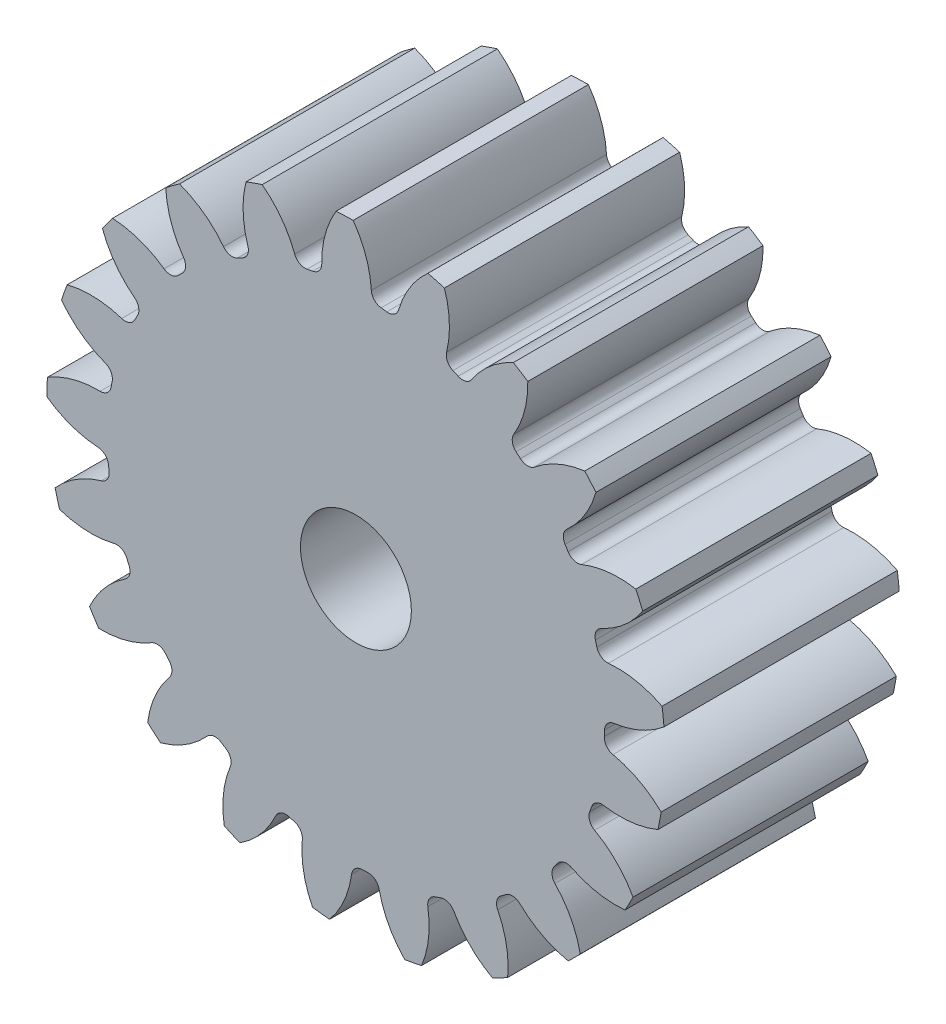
from build123d import *

# Parameters (mm, degrees)
SKETCH3_R         = 116.84
GEARBODY_DEPTH    = 88.9
TOOTHCUT_DEPTH    = 188.633635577
CIRPATTERN1_COUNT = 21
BOREDIA_R         = 20.955
BORE_DEPTH        = 12700


with BuildPart() as part:
    # Sketch3 → gearBody (new body)
    with BuildSketch(Plane.XY):
        Circle(SKETCH3_R)
    extrude(amount=GEARBODY_DEPTH)

    # Sketch2 → toothCut (cut, through all)
    with BuildSketch(Plane.XY):
        with BuildLine():
            ThreePointArc((93.863669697, -4.674602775), (93.911190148, -3.595659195), (93.946308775, -2.516240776))
            ThreePointArc((93.946308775, -2.516240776), (95.005526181, 0.138394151), (97.533525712, 1.471903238))
            ThreePointArc((97.533525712, 1.471903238), (107.813195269, 4.389920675), (116.84, 10.108594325))
            ThreePointArc((116.84, 10.108594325), (117.190598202, -4.486978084), (115.724995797, -19.013012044))
            ThreePointArc((115.724995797, -19.013012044), (107.161888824, -12.620858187), (97.135436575, -8.925362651))
            ThreePointArc((97.135436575, -8.925362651), (94.716803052, -7.402457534), (93.863669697, -4.674602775))
        make_face()
    toothcut = extrude(amount=TOOTHCUT_DEPTH, mode=Mode.SUBTRACT)

    # CirPattern1: toothCut ×21 about axis
    cirpattern1_axis = Axis((0, 0, 0), (0, 0, 1))
    for i in range(1, CIRPATTERN1_COUNT):
        add(toothcut.rotate(cirpattern1_axis, i * 360 / CIRPATTERN1_COUNT), mode=Mode.SUBTRACT)

    # boreDia → bore (cut, symmetric)
    with BuildSketch(Plane.XY):
        Circle(BOREDIA_R)
    extrude(amount=BORE_DEPTH, both=True, mode=Mode.SUBTRACT)


solid = part.part
